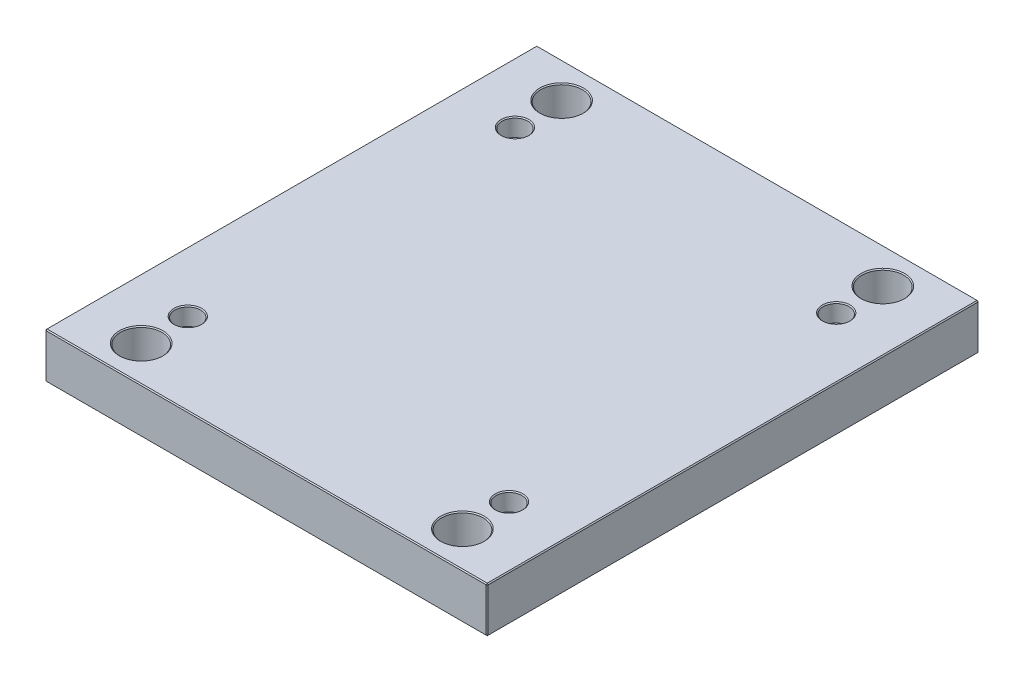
ISO-10303-21;
HEADER;
FILE_DESCRIPTION(('STEP AP214'),'2;1');
FILE_NAME('part.step','',(''),(''),'','','');
FILE_SCHEMA(('AUTOMOTIVE_DESIGN { 1 0 10303 214 1 1 1 1 }'));
ENDSEC;
DATA;
#1=APPLICATION_CONTEXT('core data for automotive mechanical design processes');
#2=APPLICATION_PROTOCOL_DEFINITION('international standard','automotive_design',2000,#1);
#3=PRODUCT_CONTEXT('',#1,'mechanical');
#4=PRODUCT('Part','Part','',(#3));
#5=PRODUCT_RELATED_PRODUCT_CATEGORY('part','',(#4));
#6=PRODUCT_DEFINITION_FORMATION('','',#4);
#7=PRODUCT_DEFINITION_CONTEXT('part definition',#1,'design');
#8=PRODUCT_DEFINITION('design','',#6,#7);
#9=PRODUCT_DEFINITION_SHAPE('','',#8);
#10=(LENGTH_UNIT() NAMED_UNIT(*) SI_UNIT(.MILLI.,.METRE.));
#11=(NAMED_UNIT(*) PLANE_ANGLE_UNIT() SI_UNIT($,.RADIAN.));
#12=(NAMED_UNIT(*) SI_UNIT($,.STERADIAN.) SOLID_ANGLE_UNIT());
#13=UNCERTAINTY_MEASURE_WITH_UNIT(LENGTH_MEASURE(1.E-05),#10,'distance_accuracy_value','');
#14=(GEOMETRIC_REPRESENTATION_CONTEXT(3) GLOBAL_UNCERTAINTY_ASSIGNED_CONTEXT((#13)) GLOBAL_UNIT_ASSIGNED_CONTEXT((#10,
#11,#12)) REPRESENTATION_CONTEXT('',''));
#15=CARTESIAN_POINT('',(0.,0.,0.));
#16=DIRECTION('',(0.,0.,1.));
#17=DIRECTION('',(1.,0.,0.));
#18=AXIS2_PLACEMENT_3D('',#15,#16,#17);
#19=CARTESIAN_POINT('',(-223.,46.,248.));
#20=DIRECTION('',(1.,0.,0.));
#21=DIRECTION('',(0.,0.,-1.));
#22=AXIS2_PLACEMENT_3D('',#19,#20,#21);
#23=PLANE('',#22);
#24=DIRECTION('',(0.,-1.,0.));
#25=VECTOR('',#24,1.);
#26=CARTESIAN_POINT('',(-223.,46.,-247.));
#27=LINE('',#26,#25);
#28=CARTESIAN_POINT('',(-223.,45.,-247.));
#29=VERTEX_POINT('',#28);
#30=CARTESIAN_POINT('',(-223.,1.00000000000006,-247.));
#31=VERTEX_POINT('',#30);
#32=EDGE_CURVE('E115',#29,#31,#27,.T.);
#33=ORIENTED_EDGE('',*,*,#32,.T.);
#34=DIRECTION('',(0.,0.,1.));
#35=VECTOR('',#34,1.);
#36=CARTESIAN_POINT('',(-223.,1.00000000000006,248.));
#37=LINE('',#36,#35);
#38=CARTESIAN_POINT('',(-223.,1.00000000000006,247.));
#39=VERTEX_POINT('',#38);
#40=EDGE_CURVE('E111',#31,#39,#37,.T.);
#41=ORIENTED_EDGE('',*,*,#40,.T.);
#42=DIRECTION('',(0.,1.,0.));
#43=VECTOR('',#42,1.);
#44=CARTESIAN_POINT('',(-223.,46.,247.));
#45=LINE('',#44,#43);
#46=CARTESIAN_POINT('',(-223.,45.,247.));
#47=VERTEX_POINT('',#46);
#48=EDGE_CURVE('E104',#39,#47,#45,.T.);
#49=ORIENTED_EDGE('',*,*,#48,.T.);
#50=DIRECTION('',(0.,0.,-1.));
#51=VECTOR('',#50,1.);
#52=CARTESIAN_POINT('',(-223.,45.,-248.));
#53=LINE('',#52,#51);
#54=EDGE_CURVE('E108',#47,#29,#53,.T.);
#55=ORIENTED_EDGE('',*,*,#54,.T.);
#56=EDGE_LOOP('',(#33,#41,#49,#55));
#57=FACE_BOUND('',#56,.T.);
#58=ADVANCED_FACE('F16',(#57),#23,.F.);
#59=CARTESIAN_POINT('',(223.,46.,248.));
#60=DIRECTION('',(0.,0.,-1.));
#61=DIRECTION('',(-1.,0.,0.));
#62=AXIS2_PLACEMENT_3D('',#59,#60,#61);
#63=PLANE('',#62);
#64=DIRECTION('',(-1.,0.,0.));
#65=VECTOR('',#64,1.);
#66=CARTESIAN_POINT('',(-223.,45.,248.));
#67=LINE('',#66,#65);
#68=CARTESIAN_POINT('',(222.,45.,248.));
#69=VERTEX_POINT('',#68);
#70=CARTESIAN_POINT('',(-222.,45.,248.));
#71=VERTEX_POINT('',#70);
#72=EDGE_CURVE('E170',#69,#71,#67,.T.);
#73=ORIENTED_EDGE('',*,*,#72,.T.);
#74=DIRECTION('',(0.,-1.,0.));
#75=VECTOR('',#74,1.);
#76=CARTESIAN_POINT('',(-222.,46.,248.));
#77=LINE('',#76,#75);
#78=CARTESIAN_POINT('',(-222.,1.00000000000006,248.));
#79=VERTEX_POINT('',#78);
#80=EDGE_CURVE('E123',#71,#79,#77,.T.);
#81=ORIENTED_EDGE('',*,*,#80,.T.);
#82=DIRECTION('',(1.,0.,0.));
#83=VECTOR('',#82,1.);
#84=CARTESIAN_POINT('',(223.,1.00000000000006,248.));
#85=LINE('',#84,#83);
#86=CARTESIAN_POINT('',(222.,1.00000000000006,248.));
#87=VERTEX_POINT('',#86);
#88=EDGE_CURVE('E174',#79,#87,#85,.T.);
#89=ORIENTED_EDGE('',*,*,#88,.T.);
#90=DIRECTION('',(0.,1.,0.));
#91=VECTOR('',#90,1.);
#92=CARTESIAN_POINT('',(222.,46.,248.));
#93=LINE('',#92,#91);
#94=EDGE_CURVE('E172',#87,#69,#93,.T.);
#95=ORIENTED_EDGE('',*,*,#94,.T.);
#96=EDGE_LOOP('',(#73,#81,#89,#95));
#97=FACE_BOUND('',#96,.T.);
#98=ADVANCED_FACE('F413',(#97),#63,.F.);
#99=CARTESIAN_POINT('',(223.,46.,248.));
#100=DIRECTION('',(-1.,0.,0.));
#101=DIRECTION('',(0.,0.,1.));
#102=AXIS2_PLACEMENT_3D('',#99,#100,#101);
#103=PLANE('',#102);
#104=DIRECTION('',(0.,0.,-1.));
#105=VECTOR('',#104,1.);
#106=CARTESIAN_POINT('',(223.,1.00000000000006,248.));
#107=LINE('',#106,#105);
#108=CARTESIAN_POINT('',(223.,1.00000000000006,247.));
#109=VERTEX_POINT('',#108);
#110=CARTESIAN_POINT('',(223.,1.00000000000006,-247.));
#111=VERTEX_POINT('',#110);
#112=EDGE_CURVE('E165',#109,#111,#107,.T.);
#113=ORIENTED_EDGE('',*,*,#112,.T.);
#114=DIRECTION('',(0.,1.,0.));
#115=VECTOR('',#114,1.);
#116=CARTESIAN_POINT('',(223.,46.,-247.));
#117=LINE('',#116,#115);
#118=CARTESIAN_POINT('',(223.,45.,-247.));
#119=VERTEX_POINT('',#118);
#120=EDGE_CURVE('E167',#111,#119,#117,.T.);
#121=ORIENTED_EDGE('',*,*,#120,.T.);
#122=DIRECTION('',(0.,0.,1.));
#123=VECTOR('',#122,1.);
#124=CARTESIAN_POINT('',(223.,45.,248.));
#125=LINE('',#124,#123);
#126=CARTESIAN_POINT('',(223.,45.,247.));
#127=VERTEX_POINT('',#126);
#128=EDGE_CURVE('E161',#119,#127,#125,.T.);
#129=ORIENTED_EDGE('',*,*,#128,.T.);
#130=DIRECTION('',(0.,-1.,0.));
#131=VECTOR('',#130,1.);
#132=CARTESIAN_POINT('',(223.,46.,247.));
#133=LINE('',#132,#131);
#134=EDGE_CURVE('E163',#127,#109,#133,.T.);
#135=ORIENTED_EDGE('',*,*,#134,.T.);
#136=EDGE_LOOP('',(#113,#121,#129,#135));
#137=FACE_BOUND('',#136,.T.);
#138=ADVANCED_FACE('F406',(#137),#103,.F.);
#139=CARTESIAN_POINT('',(223.,46.,-248.));
#140=DIRECTION('',(0.,0.,1.));
#141=DIRECTION('',(1.,0.,0.));
#142=AXIS2_PLACEMENT_3D('',#139,#140,#141);
#143=PLANE('',#142);
#144=DIRECTION('',(0.,-1.,0.));
#145=VECTOR('',#144,1.);
#146=CARTESIAN_POINT('',(222.,46.,-248.));
#147=LINE('',#146,#145);
#148=CARTESIAN_POINT('',(222.,45.,-248.));
#149=VERTEX_POINT('',#148);
#150=CARTESIAN_POINT('',(222.,1.00000000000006,-248.));
#151=VERTEX_POINT('',#150);
#152=EDGE_CURVE('E154',#149,#151,#147,.T.);
#153=ORIENTED_EDGE('',*,*,#152,.T.);
#154=DIRECTION('',(-1.,0.,0.));
#155=VECTOR('',#154,1.);
#156=CARTESIAN_POINT('',(223.,1.00000000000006,-248.));
#157=LINE('',#156,#155);
#158=CARTESIAN_POINT('',(-222.,1.00000000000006,-248.));
#159=VERTEX_POINT('',#158);
#160=EDGE_CURVE('E159',#151,#159,#157,.T.);
#161=ORIENTED_EDGE('',*,*,#160,.T.);
#162=DIRECTION('',(0.,1.,0.));
#163=VECTOR('',#162,1.);
#164=CARTESIAN_POINT('',(-222.,46.,-248.));
#165=LINE('',#164,#163);
#166=CARTESIAN_POINT('',(-222.,45.,-248.));
#167=VERTEX_POINT('',#166);
#168=EDGE_CURVE('E156',#159,#167,#165,.T.);
#169=ORIENTED_EDGE('',*,*,#168,.T.);
#170=DIRECTION('',(1.,0.,0.));
#171=VECTOR('',#170,1.);
#172=CARTESIAN_POINT('',(223.,45.,-248.));
#173=LINE('',#172,#171);
#174=EDGE_CURVE('E152',#167,#149,#173,.T.);
#175=ORIENTED_EDGE('',*,*,#174,.T.);
#176=EDGE_LOOP('',(#153,#161,#169,#175));
#177=FACE_BOUND('',#176,.T.);
#178=ADVANCED_FACE('F431',(#177),#143,.F.);
#179=CARTESIAN_POINT('',(0.,46.,0.));
#180=DIRECTION('',(0.,1.,0.));
#181=DIRECTION('',(0.,0.,1.));
#182=AXIS2_PLACEMENT_3D('',#179,#180,#181);
#183=PLANE('',#182);
#184=CARTESIAN_POINT('',(-162.,46.,212.));
#185=DIRECTION('',(0.,1.,0.));
#186=DIRECTION('',(0.,0.,1.));
#187=AXIS2_PLACEMENT_3D('',#184,#185,#186);
#188=CIRCLE('',#187,22.);
#189=CARTESIAN_POINT('',(-162.,46.,234.));
#190=VERTEX_POINT('',#189);
#191=EDGE_CURVE('E317',#190,#190,#188,.F.);
#192=ORIENTED_EDGE('',*,*,#191,.T.);
#193=EDGE_LOOP('',(#192));
#194=FACE_BOUND('',#193,.T.);
#195=CARTESIAN_POINT('',(162.,46.,212.));
#196=DIRECTION('',(0.,1.,0.));
#197=DIRECTION('',(0.,0.,1.));
#198=AXIS2_PLACEMENT_3D('',#195,#196,#197);
#199=CIRCLE('',#198,22.);
#200=CARTESIAN_POINT('',(162.,46.,234.));
#201=VERTEX_POINT('',#200);
#202=EDGE_CURVE('E314',#201,#201,#199,.F.);
#203=ORIENTED_EDGE('',*,*,#202,.T.);
#204=EDGE_LOOP('',(#203));
#205=FACE_BOUND('',#204,.T.);
#206=CARTESIAN_POINT('',(162.,46.,-212.));
#207=DIRECTION('',(0.,1.,0.));
#208=DIRECTION('',(0.,0.,1.));
#209=AXIS2_PLACEMENT_3D('',#206,#207,#208);
#210=CIRCLE('',#209,22.);
#211=CARTESIAN_POINT('',(162.,46.,-190.));
#212=VERTEX_POINT('',#211);
#213=EDGE_CURVE('E311',#212,#212,#210,.F.);
#214=ORIENTED_EDGE('',*,*,#213,.T.);
#215=EDGE_LOOP('',(#214));
#216=FACE_BOUND('',#215,.T.);
#217=CARTESIAN_POINT('',(-162.,46.,-212.));
#218=DIRECTION('',(0.,1.,0.));
#219=DIRECTION('',(0.,0.,1.));
#220=AXIS2_PLACEMENT_3D('',#217,#218,#219);
#221=CIRCLE('',#220,22.);
#222=CARTESIAN_POINT('',(-162.,46.,-190.));
#223=VERTEX_POINT('',#222);
#224=EDGE_CURVE('E308',#223,#223,#221,.F.);
#225=ORIENTED_EDGE('',*,*,#224,.T.);
#226=EDGE_LOOP('',(#225));
#227=FACE_BOUND('',#226,.T.);
#228=CARTESIAN_POINT('',(-162.,46.,165.));
#229=DIRECTION('',(0.,1.,0.));
#230=DIRECTION('',(0.,0.,1.));
#231=AXIS2_PLACEMENT_3D('',#228,#229,#230);
#232=CIRCLE('',#231,14.0000000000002);
#233=CARTESIAN_POINT('',(-162.,46.,179.));
#234=VERTEX_POINT('',#233);
#235=EDGE_CURVE('E290',#234,#234,#232,.F.);
#236=ORIENTED_EDGE('',*,*,#235,.T.);
#237=EDGE_LOOP('',(#236));
#238=FACE_BOUND('',#237,.T.);
#239=CARTESIAN_POINT('',(162.,46.,165.));
#240=DIRECTION('',(0.,1.,0.));
#241=DIRECTION('',(0.,0.,1.));
#242=AXIS2_PLACEMENT_3D('',#239,#240,#241);
#243=CIRCLE('',#242,13.9999999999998);
#244=CARTESIAN_POINT('',(162.,46.,179.));
#245=VERTEX_POINT('',#244);
#246=EDGE_CURVE('E287',#245,#245,#243,.F.);
#247=ORIENTED_EDGE('',*,*,#246,.T.);
#248=EDGE_LOOP('',(#247));
#249=FACE_BOUND('',#248,.T.);
#250=CARTESIAN_POINT('',(162.,46.,-165.));
#251=DIRECTION('',(0.,1.,0.));
#252=DIRECTION('',(0.,0.,1.));
#253=AXIS2_PLACEMENT_3D('',#250,#251,#252);
#254=CIRCLE('',#253,14.0000000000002);
#255=CARTESIAN_POINT('',(162.,46.,-151.));
#256=VERTEX_POINT('',#255);
#257=EDGE_CURVE('E284',#256,#256,#254,.F.);
#258=ORIENTED_EDGE('',*,*,#257,.T.);
#259=EDGE_LOOP('',(#258));
#260=FACE_BOUND('',#259,.T.);
#261=CARTESIAN_POINT('',(-162.,46.,-165.));
#262=DIRECTION('',(0.,1.,0.));
#263=DIRECTION('',(0.,0.,1.));
#264=AXIS2_PLACEMENT_3D('',#261,#262,#263);
#265=CIRCLE('',#264,13.9999999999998);
#266=CARTESIAN_POINT('',(-162.,46.,-151.));
#267=VERTEX_POINT('',#266);
#268=EDGE_CURVE('E281',#267,#267,#265,.F.);
#269=ORIENTED_EDGE('',*,*,#268,.T.);
#270=EDGE_LOOP('',(#269));
#271=FACE_BOUND('',#270,.T.);
#272=DIRECTION('',(0.,0.,-1.));
#273=VECTOR('',#272,1.);
#274=CARTESIAN_POINT('',(222.,46.,-248.));
#275=LINE('',#274,#273);
#276=CARTESIAN_POINT('',(222.,46.,247.));
#277=VERTEX_POINT('',#276);
#278=CARTESIAN_POINT('',(222.,46.,-247.));
#279=VERTEX_POINT('',#278);
#280=EDGE_CURVE('E31',#277,#279,#275,.T.);
#281=ORIENTED_EDGE('',*,*,#280,.T.);
#282=DIRECTION('',(-1.,0.,0.));
#283=VECTOR('',#282,1.);
#284=CARTESIAN_POINT('',(-223.,46.,-247.));
#285=LINE('',#284,#283);
#286=CARTESIAN_POINT('',(-222.,46.,-247.));
#287=VERTEX_POINT('',#286);
#288=EDGE_CURVE('E190',#279,#287,#285,.T.);
#289=ORIENTED_EDGE('',*,*,#288,.T.);
#290=DIRECTION('',(0.,0.,1.));
#291=VECTOR('',#290,1.);
#292=CARTESIAN_POINT('',(-222.,46.,248.));
#293=LINE('',#292,#291);
#294=CARTESIAN_POINT('',(-222.,46.,247.));
#295=VERTEX_POINT('',#294);
#296=EDGE_CURVE('E186',#287,#295,#293,.T.);
#297=ORIENTED_EDGE('',*,*,#296,.T.);
#298=DIRECTION('',(1.,0.,0.));
#299=VECTOR('',#298,1.);
#300=CARTESIAN_POINT('',(223.,46.,247.));
#301=LINE('',#300,#299);
#302=EDGE_CURVE('E36',#295,#277,#301,.T.);
#303=ORIENTED_EDGE('',*,*,#302,.T.);
#304=EDGE_LOOP('',(#281,#289,#297,#303));
#305=FACE_BOUND('',#304,.T.);
#306=ADVANCED_FACE('F357',(#194,#205,#216,#227,#238,#249,#260,#271,#305),#183,.T.);
#307=CARTESIAN_POINT('',(0.,0.,0.));
#308=DIRECTION('',(0.,1.,0.));
#309=DIRECTION('',(0.,0.,1.));
#310=AXIS2_PLACEMENT_3D('',#307,#308,#309);
#311=PLANE('',#310);
#312=CARTESIAN_POINT('',(-162.,0.,212.));
#313=DIRECTION('',(0.,1.,0.));
#314=DIRECTION('',(0.,0.,1.));
#315=AXIS2_PLACEMENT_3D('',#312,#313,#314);
#316=CIRCLE('',#315,22.);
#317=CARTESIAN_POINT('',(-162.,0.,234.));
#318=VERTEX_POINT('',#317);
#319=EDGE_CURVE('E329',#318,#318,#316,.T.);
#320=ORIENTED_EDGE('',*,*,#319,.T.);
#321=EDGE_LOOP('',(#320));
#322=FACE_BOUND('',#321,.T.);
#323=CARTESIAN_POINT('',(162.,0.,212.));
#324=DIRECTION('',(0.,1.,0.));
#325=DIRECTION('',(0.,0.,1.));
#326=AXIS2_PLACEMENT_3D('',#323,#324,#325);
#327=CIRCLE('',#326,22.);
#328=CARTESIAN_POINT('',(162.,0.,234.));
#329=VERTEX_POINT('',#328);
#330=EDGE_CURVE('E326',#329,#329,#327,.T.);
#331=ORIENTED_EDGE('',*,*,#330,.T.);
#332=EDGE_LOOP('',(#331));
#333=FACE_BOUND('',#332,.T.);
#334=CARTESIAN_POINT('',(162.,0.,-212.));
#335=DIRECTION('',(0.,1.,0.));
#336=DIRECTION('',(0.,0.,1.));
#337=AXIS2_PLACEMENT_3D('',#334,#335,#336);
#338=CIRCLE('',#337,22.);
#339=CARTESIAN_POINT('',(162.,0.,-190.));
#340=VERTEX_POINT('',#339);
#341=EDGE_CURVE('E323',#340,#340,#338,.T.);
#342=ORIENTED_EDGE('',*,*,#341,.T.);
#343=EDGE_LOOP('',(#342));
#344=FACE_BOUND('',#343,.T.);
#345=CARTESIAN_POINT('',(-162.,0.,-212.));
#346=DIRECTION('',(0.,1.,0.));
#347=DIRECTION('',(0.,0.,1.));
#348=AXIS2_PLACEMENT_3D('',#345,#346,#347);
#349=CIRCLE('',#348,22.);
#350=CARTESIAN_POINT('',(-162.,0.,-190.));
#351=VERTEX_POINT('',#350);
#352=EDGE_CURVE('E320',#351,#351,#349,.T.);
#353=ORIENTED_EDGE('',*,*,#352,.T.);
#354=EDGE_LOOP('',(#353));
#355=FACE_BOUND('',#354,.T.);
#356=CARTESIAN_POINT('',(162.,0.,-165.));
#357=DIRECTION('',(0.,1.,0.));
#358=DIRECTION('',(0.,0.,1.));
#359=AXIS2_PLACEMENT_3D('',#356,#357,#358);
#360=CIRCLE('',#359,10.0000000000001);
#361=CARTESIAN_POINT('',(162.,0.,-155.));
#362=VERTEX_POINT('',#361);
#363=EDGE_CURVE('E263',#362,#362,#360,.T.);
#364=ORIENTED_EDGE('',*,*,#363,.T.);
#365=EDGE_LOOP('',(#364));
#366=FACE_BOUND('',#365,.T.);
#367=CARTESIAN_POINT('',(162.,0.,165.));
#368=DIRECTION('',(0.,1.,0.));
#369=DIRECTION('',(0.,0.,1.));
#370=AXIS2_PLACEMENT_3D('',#367,#368,#369);
#371=CIRCLE('',#370,10.);
#372=CARTESIAN_POINT('',(162.,0.,175.));
#373=VERTEX_POINT('',#372);
#374=EDGE_CURVE('E260',#373,#373,#371,.T.);
#375=ORIENTED_EDGE('',*,*,#374,.T.);
#376=EDGE_LOOP('',(#375));
#377=FACE_BOUND('',#376,.T.);
#378=CARTESIAN_POINT('',(-162.,0.,165.));
#379=DIRECTION('',(0.,1.,0.));
#380=DIRECTION('',(0.,0.,1.));
#381=AXIS2_PLACEMENT_3D('',#378,#379,#380);
#382=CIRCLE('',#381,10.0000000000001);
#383=CARTESIAN_POINT('',(-162.,0.,175.));
#384=VERTEX_POINT('',#383);
#385=EDGE_CURVE('E257',#384,#384,#382,.T.);
#386=ORIENTED_EDGE('',*,*,#385,.T.);
#387=EDGE_LOOP('',(#386));
#388=FACE_BOUND('',#387,.T.);
#389=CARTESIAN_POINT('',(-162.,0.,-165.));
#390=DIRECTION('',(0.,1.,0.));
#391=DIRECTION('',(0.,0.,1.));
#392=AXIS2_PLACEMENT_3D('',#389,#390,#391);
#393=CIRCLE('',#392,10.);
#394=CARTESIAN_POINT('',(-162.,0.,-155.));
#395=VERTEX_POINT('',#394);
#396=EDGE_CURVE('E192',#395,#395,#393,.T.);
#397=ORIENTED_EDGE('',*,*,#396,.T.);
#398=EDGE_LOOP('',(#397));
#399=FACE_BOUND('',#398,.T.);
#400=DIRECTION('',(0.,0.,1.));
#401=VECTOR('',#400,1.);
#402=CARTESIAN_POINT('',(222.,0.,0.));
#403=LINE('',#402,#401);
#404=CARTESIAN_POINT('',(222.,0.,-247.));
#405=VERTEX_POINT('',#404);
#406=CARTESIAN_POINT('',(222.,0.,247.));
#407=VERTEX_POINT('',#406);
#408=EDGE_CURVE('E177',#405,#407,#403,.T.);
#409=ORIENTED_EDGE('',*,*,#408,.T.);
#410=DIRECTION('',(-1.,0.,0.));
#411=VECTOR('',#410,1.);
#412=CARTESIAN_POINT('',(0.,0.,247.));
#413=LINE('',#412,#411);
#414=CARTESIAN_POINT('',(-222.,0.,247.));
#415=VERTEX_POINT('',#414);
#416=EDGE_CURVE('E183',#407,#415,#413,.T.);
#417=ORIENTED_EDGE('',*,*,#416,.T.);
#418=DIRECTION('',(0.,0.,-1.));
#419=VECTOR('',#418,1.);
#420=CARTESIAN_POINT('',(-222.,0.,0.));
#421=LINE('',#420,#419);
#422=CARTESIAN_POINT('',(-222.,0.,-247.));
#423=VERTEX_POINT('',#422);
#424=EDGE_CURVE('E181',#415,#423,#421,.T.);
#425=ORIENTED_EDGE('',*,*,#424,.T.);
#426=DIRECTION('',(1.,0.,0.));
#427=VECTOR('',#426,1.);
#428=CARTESIAN_POINT('',(0.,0.,-247.));
#429=LINE('',#428,#427);
#430=EDGE_CURVE('E179',#423,#405,#429,.T.);
#431=ORIENTED_EDGE('',*,*,#430,.T.);
#432=EDGE_LOOP('',(#409,#417,#425,#431));
#433=FACE_BOUND('',#432,.T.);
#434=ADVANCED_FACE('F353',(#322,#333,#344,#355,#366,#377,#388,#399,#433),#311,.F.);
#435=CARTESIAN_POINT('',(223.,46.,247.));
#436=DIRECTION('',(-0.707106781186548,0.,-0.707106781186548));
#437=DIRECTION('',(0.,-1.,0.));
#438=AXIS2_PLACEMENT_3D('',#435,#436,#437);
#439=PLANE('',#438);
#440=DIRECTION('',(-0.707106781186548,0.,0.707106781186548));
#441=VECTOR('',#440,1.);
#442=CARTESIAN_POINT('',(222.,45.,248.));
#443=LINE('',#442,#441);
#444=EDGE_CURVE('E141',#69,#127,#443,.F.);
#445=ORIENTED_EDGE('',*,*,#444,.F.);
#446=ORIENTED_EDGE('',*,*,#94,.F.);
#447=DIRECTION('',(0.707106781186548,0.,-0.707106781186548));
#448=VECTOR('',#447,1.);
#449=CARTESIAN_POINT('',(222.,1.00000000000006,248.));
#450=LINE('',#449,#448);
#451=EDGE_CURVE('E144',#109,#87,#450,.F.);
#452=ORIENTED_EDGE('',*,*,#451,.F.);
#453=ORIENTED_EDGE('',*,*,#134,.F.);
#454=EDGE_LOOP('',(#445,#446,#452,#453));
#455=FACE_BOUND('',#454,.T.);
#456=ADVANCED_FACE('F356',(#455),#439,.F.);
#457=CARTESIAN_POINT('',(222.,45.,248.));
#458=DIRECTION('',(0.577350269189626,0.577350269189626,0.577350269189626));
#459=DIRECTION('',(0.707106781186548,0.,-0.707106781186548));
#460=AXIS2_PLACEMENT_3D('',#457,#458,#459);
#461=PLANE('',#460);
#462=DIRECTION('',(0.,-0.707106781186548,0.707106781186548));
#463=VECTOR('',#462,1.);
#464=CARTESIAN_POINT('',(222.,45.,248.));
#465=LINE('',#464,#463);
#466=EDGE_CURVE('E235',#69,#277,#465,.F.);
#467=ORIENTED_EDGE('',*,*,#466,.F.);
#468=ORIENTED_EDGE('',*,*,#444,.T.);
#469=DIRECTION('',(-0.707106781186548,0.707106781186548,0.));
#470=VECTOR('',#469,1.);
#471=CARTESIAN_POINT('',(222.5,45.5,247.));
#472=LINE('',#471,#470);
#473=EDGE_CURVE('E237',#277,#127,#472,.F.);
#474=ORIENTED_EDGE('',*,*,#473,.F.);
#475=EDGE_LOOP('',(#467,#468,#474));
#476=FACE_BOUND('',#475,.T.);
#477=ADVANCED_FACE('F419',(#476),#461,.T.);
#478=CARTESIAN_POINT('',(222.,1.00000000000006,248.));
#479=DIRECTION('',(0.577350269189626,-0.577350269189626,0.577350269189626));
#480=DIRECTION('',(0.707106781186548,0.,-0.707106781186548));
#481=AXIS2_PLACEMENT_3D('',#478,#479,#480);
#482=PLANE('',#481);
#483=DIRECTION('',(-0.707106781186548,-0.707106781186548,0.));
#484=VECTOR('',#483,1.);
#485=CARTESIAN_POINT('',(222.5,0.500000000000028,247.));
#486=LINE('',#485,#484);
#487=EDGE_CURVE('E229',#109,#407,#486,.T.);
#488=ORIENTED_EDGE('',*,*,#487,.F.);
#489=ORIENTED_EDGE('',*,*,#451,.T.);
#490=DIRECTION('',(0.,0.707106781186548,0.707106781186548));
#491=VECTOR('',#490,1.);
#492=CARTESIAN_POINT('',(222.,1.00000000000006,248.));
#493=LINE('',#492,#491);
#494=EDGE_CURVE('E232',#407,#87,#493,.T.);
#495=ORIENTED_EDGE('',*,*,#494,.F.);
#496=EDGE_LOOP('',(#488,#489,#495));
#497=FACE_BOUND('',#496,.T.);
#498=ADVANCED_FACE('F378',(#497),#482,.T.);
#499=CARTESIAN_POINT('',(222.,46.,0.));
#500=DIRECTION('',(0.707106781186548,0.707106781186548,0.));
#501=DIRECTION('',(0.,0.,1.));
#502=AXIS2_PLACEMENT_3D('',#499,#500,#501);
#503=PLANE('',#502);
#504=ORIENTED_EDGE('',*,*,#473,.T.);
#505=ORIENTED_EDGE('',*,*,#128,.F.);
#506=DIRECTION('',(0.707106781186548,-0.707106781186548,0.));
#507=VECTOR('',#506,1.);
#508=CARTESIAN_POINT('',(223.,45.,-247.));
#509=LINE('',#508,#507);
#510=EDGE_CURVE('E224',#279,#119,#509,.T.);
#511=ORIENTED_EDGE('',*,*,#510,.F.);
#512=ORIENTED_EDGE('',*,*,#280,.F.);
#513=EDGE_LOOP('',(#504,#505,#511,#512));
#514=FACE_BOUND('',#513,.T.);
#515=ADVANCED_FACE('F421',(#514),#503,.T.);
#516=CARTESIAN_POINT('',(0.,46.,247.));
#517=DIRECTION('',(0.,0.707106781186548,0.707106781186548));
#518=DIRECTION('',(-1.,0.,0.));
#519=AXIS2_PLACEMENT_3D('',#516,#517,#518);
#520=PLANE('',#519);
#521=ORIENTED_EDGE('',*,*,#466,.T.);
#522=ORIENTED_EDGE('',*,*,#302,.F.);
#523=DIRECTION('',(0.,0.707106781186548,-0.707106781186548));
#524=VECTOR('',#523,1.);
#525=CARTESIAN_POINT('',(-222.,45.5,247.5));
#526=LINE('',#525,#524);
#527=EDGE_CURVE('E127',#71,#295,#526,.T.);
#528=ORIENTED_EDGE('',*,*,#527,.F.);
#529=ORIENTED_EDGE('',*,*,#72,.F.);
#530=EDGE_LOOP('',(#521,#522,#528,#529));
#531=FACE_BOUND('',#530,.T.);
#532=ADVANCED_FACE('F416',(#531),#520,.T.);
#533=CARTESIAN_POINT('',(-222.,46.,248.));
#534=DIRECTION('',(0.707106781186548,0.,-0.707106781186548));
#535=DIRECTION('',(0.,-1.,0.));
#536=AXIS2_PLACEMENT_3D('',#533,#534,#535);
#537=PLANE('',#536);
#538=DIRECTION('',(0.707106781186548,0.,0.707106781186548));
#539=VECTOR('',#538,1.);
#540=CARTESIAN_POINT('',(-222.,1.00000000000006,248.));
#541=LINE('',#540,#539);
#542=EDGE_CURVE('E128',#79,#39,#541,.F.);
#543=ORIENTED_EDGE('',*,*,#542,.F.);
#544=ORIENTED_EDGE('',*,*,#80,.F.);
#545=DIRECTION('',(-0.707106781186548,0.,-0.707106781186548));
#546=VECTOR('',#545,1.);
#547=CARTESIAN_POINT('',(-223.,45.,247.));
#548=LINE('',#547,#546);
#549=EDGE_CURVE('E119',#47,#71,#548,.F.);
#550=ORIENTED_EDGE('',*,*,#549,.F.);
#551=ORIENTED_EDGE('',*,*,#48,.F.);
#552=EDGE_LOOP('',(#543,#544,#550,#551));
#553=FACE_BOUND('',#552,.T.);
#554=ADVANCED_FACE('F121',(#553),#537,.F.);
#555=CARTESIAN_POINT('',(223.,1.00000000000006,248.));
#556=DIRECTION('',(0.,0.707106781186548,-0.707106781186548));
#557=DIRECTION('',(1.,0.,0.));
#558=AXIS2_PLACEMENT_3D('',#555,#556,#557);
#559=PLANE('',#558);
#560=ORIENTED_EDGE('',*,*,#494,.T.);
#561=ORIENTED_EDGE('',*,*,#88,.F.);
#562=DIRECTION('',(0.,-0.707106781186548,-0.707106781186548));
#563=VECTOR('',#562,1.);
#564=CARTESIAN_POINT('',(-222.,1.00000000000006,248.));
#565=LINE('',#564,#563);
#566=EDGE_CURVE('E220',#415,#79,#565,.F.);
#567=ORIENTED_EDGE('',*,*,#566,.F.);
#568=ORIENTED_EDGE('',*,*,#416,.F.);
#569=EDGE_LOOP('',(#560,#561,#567,#568));
#570=FACE_BOUND('',#569,.T.);
#571=ADVANCED_FACE('F383',(#570),#559,.F.);
#572=CARTESIAN_POINT('',(223.,1.00000000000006,248.));
#573=DIRECTION('',(-0.707106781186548,0.707106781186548,0.));
#574=DIRECTION('',(0.,0.,-1.));
#575=AXIS2_PLACEMENT_3D('',#572,#573,#574);
#576=PLANE('',#575);
#577=ORIENTED_EDGE('',*,*,#487,.T.);
#578=ORIENTED_EDGE('',*,*,#408,.F.);
#579=DIRECTION('',(0.707106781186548,0.707106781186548,0.));
#580=VECTOR('',#579,1.);
#581=CARTESIAN_POINT('',(222.5,0.500000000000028,-247.));
#582=LINE('',#581,#580);
#583=EDGE_CURVE('E217',#111,#405,#582,.F.);
#584=ORIENTED_EDGE('',*,*,#583,.F.);
#585=ORIENTED_EDGE('',*,*,#112,.F.);
#586=EDGE_LOOP('',(#577,#578,#584,#585));
#587=FACE_BOUND('',#586,.T.);
#588=ADVANCED_FACE('F376',(#587),#576,.F.);
#589=CARTESIAN_POINT('',(222.,46.,-248.));
#590=DIRECTION('',(-0.707106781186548,0.,0.707106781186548));
#591=DIRECTION('',(0.,-1.,0.));
#592=AXIS2_PLACEMENT_3D('',#589,#590,#591);
#593=PLANE('',#592);
#594=DIRECTION('',(0.707106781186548,0.,0.707106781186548));
#595=VECTOR('',#594,1.);
#596=CARTESIAN_POINT('',(223.,45.,-247.));
#597=LINE('',#596,#595);
#598=EDGE_CURVE('E226',#119,#149,#597,.F.);
#599=ORIENTED_EDGE('',*,*,#598,.F.);
#600=ORIENTED_EDGE('',*,*,#120,.F.);
#601=DIRECTION('',(-0.707106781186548,0.,-0.707106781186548));
#602=VECTOR('',#601,1.);
#603=CARTESIAN_POINT('',(222.,1.00000000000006,-248.));
#604=LINE('',#603,#602);
#605=EDGE_CURVE('E214',#151,#111,#604,.F.);
#606=ORIENTED_EDGE('',*,*,#605,.F.);
#607=ORIENTED_EDGE('',*,*,#152,.F.);
#608=EDGE_LOOP('',(#599,#600,#606,#607));
#609=FACE_BOUND('',#608,.T.);
#610=ADVANCED_FACE('F403',(#609),#593,.F.);
#611=CARTESIAN_POINT('',(223.,45.,-247.));
#612=DIRECTION('',(0.577350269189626,0.577350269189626,-0.577350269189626));
#613=DIRECTION('',(-0.707106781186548,0.,-0.707106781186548));
#614=AXIS2_PLACEMENT_3D('',#611,#612,#613);
#615=PLANE('',#614);
#616=ORIENTED_EDGE('',*,*,#510,.T.);
#617=ORIENTED_EDGE('',*,*,#598,.T.);
#618=DIRECTION('',(0.,0.707106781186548,0.707106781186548));
#619=VECTOR('',#618,1.);
#620=CARTESIAN_POINT('',(222.,45.5,-247.5));
#621=LINE('',#620,#619);
#622=EDGE_CURVE('E135',#279,#149,#621,.F.);
#623=ORIENTED_EDGE('',*,*,#622,.F.);
#624=EDGE_LOOP('',(#616,#617,#623));
#625=FACE_BOUND('',#624,.T.);
#626=ADVANCED_FACE('F425',(#625),#615,.T.);
#627=CARTESIAN_POINT('',(-223.,45.,247.));
#628=DIRECTION('',(-0.577350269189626,0.577350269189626,0.577350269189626));
#629=DIRECTION('',(0.707106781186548,0.,0.707106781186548));
#630=AXIS2_PLACEMENT_3D('',#627,#628,#629);
#631=PLANE('',#630);
#632=ORIENTED_EDGE('',*,*,#549,.T.);
#633=ORIENTED_EDGE('',*,*,#527,.T.);
#634=DIRECTION('',(-0.707106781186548,-0.707106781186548,0.));
#635=VECTOR('',#634,1.);
#636=CARTESIAN_POINT('',(-223.,45.,247.));
#637=LINE('',#636,#635);
#638=EDGE_CURVE('E131',#47,#295,#637,.F.);
#639=ORIENTED_EDGE('',*,*,#638,.F.);
#640=EDGE_LOOP('',(#632,#633,#639));
#641=FACE_BOUND('',#640,.T.);
#642=ADVANCED_FACE('F132',(#641),#631,.T.);
#643=CARTESIAN_POINT('',(-222.,1.00000000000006,248.));
#644=DIRECTION('',(-0.577350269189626,-0.577350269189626,0.577350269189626));
#645=DIRECTION('',(0.707106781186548,0.,0.707106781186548));
#646=AXIS2_PLACEMENT_3D('',#643,#644,#645);
#647=PLANE('',#646);
#648=ORIENTED_EDGE('',*,*,#566,.T.);
#649=ORIENTED_EDGE('',*,*,#542,.T.);
#650=DIRECTION('',(-0.707106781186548,0.707106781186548,0.));
#651=VECTOR('',#650,1.);
#652=CARTESIAN_POINT('',(-222.5,0.500000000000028,247.));
#653=LINE('',#652,#651);
#654=EDGE_CURVE('E136',#415,#39,#653,.T.);
#655=ORIENTED_EDGE('',*,*,#654,.F.);
#656=EDGE_LOOP('',(#648,#649,#655));
#657=FACE_BOUND('',#656,.T.);
#658=ADVANCED_FACE('F386',(#657),#647,.T.);
#659=CARTESIAN_POINT('',(222.,1.00000000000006,-248.));
#660=DIRECTION('',(0.577350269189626,-0.577350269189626,-0.577350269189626));
#661=DIRECTION('',(-0.707106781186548,0.,-0.707106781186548));
#662=AXIS2_PLACEMENT_3D('',#659,#660,#661);
#663=PLANE('',#662);
#664=ORIENTED_EDGE('',*,*,#605,.T.);
#665=ORIENTED_EDGE('',*,*,#583,.T.);
#666=DIRECTION('',(0.,-0.707106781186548,0.707106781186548));
#667=VECTOR('',#666,1.);
#668=CARTESIAN_POINT('',(222.,1.00000000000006,-248.));
#669=LINE('',#668,#667);
#670=EDGE_CURVE('E207',#151,#405,#669,.T.);
#671=ORIENTED_EDGE('',*,*,#670,.F.);
#672=EDGE_LOOP('',(#664,#665,#671));
#673=FACE_BOUND('',#672,.T.);
#674=ADVANCED_FACE('F397',(#673),#663,.T.);
#675=CARTESIAN_POINT('',(0.,46.,-247.));
#676=DIRECTION('',(0.,0.707106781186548,-0.707106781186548));
#677=DIRECTION('',(1.,0.,0.));
#678=AXIS2_PLACEMENT_3D('',#675,#676,#677);
#679=PLANE('',#678);
#680=ORIENTED_EDGE('',*,*,#622,.T.);
#681=ORIENTED_EDGE('',*,*,#174,.F.);
#682=DIRECTION('',(0.,-0.707106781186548,-0.707106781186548));
#683=VECTOR('',#682,1.);
#684=CARTESIAN_POINT('',(-222.,45.,-248.));
#685=LINE('',#684,#683);
#686=EDGE_CURVE('E204',#287,#167,#685,.T.);
#687=ORIENTED_EDGE('',*,*,#686,.F.);
#688=ORIENTED_EDGE('',*,*,#288,.F.);
#689=EDGE_LOOP('',(#680,#681,#687,#688));
#690=FACE_BOUND('',#689,.T.);
#691=ADVANCED_FACE('F429',(#690),#679,.T.);
#692=CARTESIAN_POINT('',(-222.,46.,0.));
#693=DIRECTION('',(-0.707106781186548,0.707106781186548,0.));
#694=DIRECTION('',(0.,0.,-1.));
#695=AXIS2_PLACEMENT_3D('',#692,#693,#694);
#696=PLANE('',#695);
#697=ORIENTED_EDGE('',*,*,#638,.T.);
#698=ORIENTED_EDGE('',*,*,#296,.F.);
#699=DIRECTION('',(0.707106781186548,0.707106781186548,0.));
#700=VECTOR('',#699,1.);
#701=CARTESIAN_POINT('',(-222.5,45.5,-247.));
#702=LINE('',#701,#700);
#703=EDGE_CURVE('E139',#29,#287,#702,.T.);
#704=ORIENTED_EDGE('',*,*,#703,.F.);
#705=ORIENTED_EDGE('',*,*,#54,.F.);
#706=EDGE_LOOP('',(#697,#698,#704,#705));
#707=FACE_BOUND('',#706,.T.);
#708=ADVANCED_FACE('F138',(#707),#696,.T.);
#709=CARTESIAN_POINT('',(-223.,1.00000000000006,248.));
#710=DIRECTION('',(0.707106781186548,0.707106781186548,0.));
#711=DIRECTION('',(0.,0.,1.));
#712=AXIS2_PLACEMENT_3D('',#709,#710,#711);
#713=PLANE('',#712);
#714=ORIENTED_EDGE('',*,*,#654,.T.);
#715=ORIENTED_EDGE('',*,*,#40,.F.);
#716=DIRECTION('',(0.707106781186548,-0.707106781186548,0.));
#717=VECTOR('',#716,1.);
#718=CARTESIAN_POINT('',(-223.,1.00000000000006,-247.));
#719=LINE('',#718,#717);
#720=EDGE_CURVE('E200',#423,#31,#719,.F.);
#721=ORIENTED_EDGE('',*,*,#720,.F.);
#722=ORIENTED_EDGE('',*,*,#424,.F.);
#723=EDGE_LOOP('',(#714,#715,#721,#722));
#724=FACE_BOUND('',#723,.T.);
#725=ADVANCED_FACE('F388',(#724),#713,.F.);
#726=CARTESIAN_POINT('',(223.,1.00000000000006,-248.));
#727=DIRECTION('',(0.,0.707106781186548,0.707106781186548));
#728=DIRECTION('',(-1.,0.,0.));
#729=AXIS2_PLACEMENT_3D('',#726,#727,#728);
#730=PLANE('',#729);
#731=ORIENTED_EDGE('',*,*,#670,.T.);
#732=ORIENTED_EDGE('',*,*,#430,.F.);
#733=DIRECTION('',(0.,0.707106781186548,-0.707106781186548));
#734=VECTOR('',#733,1.);
#735=CARTESIAN_POINT('',(-222.,0.500000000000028,-247.5));
#736=LINE('',#735,#734);
#737=EDGE_CURVE('E197',#159,#423,#736,.F.);
#738=ORIENTED_EDGE('',*,*,#737,.F.);
#739=ORIENTED_EDGE('',*,*,#160,.F.);
#740=EDGE_LOOP('',(#731,#732,#738,#739));
#741=FACE_BOUND('',#740,.T.);
#742=ADVANCED_FACE('F392',(#741),#730,.F.);
#743=CARTESIAN_POINT('',(-222.,45.,-248.));
#744=DIRECTION('',(-0.577350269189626,0.577350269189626,-0.577350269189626));
#745=DIRECTION('',(-0.707106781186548,0.,0.707106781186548));
#746=AXIS2_PLACEMENT_3D('',#743,#744,#745);
#747=PLANE('',#746);
#748=ORIENTED_EDGE('',*,*,#703,.T.);
#749=ORIENTED_EDGE('',*,*,#686,.T.);
#750=DIRECTION('',(0.707106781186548,0.,-0.707106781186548));
#751=VECTOR('',#750,1.);
#752=CARTESIAN_POINT('',(-222.,45.,-248.));
#753=LINE('',#752,#751);
#754=EDGE_CURVE('E195',#29,#167,#753,.T.);
#755=ORIENTED_EDGE('',*,*,#754,.F.);
#756=EDGE_LOOP('',(#748,#749,#755));
#757=FACE_BOUND('',#756,.T.);
#758=ADVANCED_FACE('F460',(#757),#747,.T.);
#759=CARTESIAN_POINT('',(-223.,1.00000000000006,-247.));
#760=DIRECTION('',(-0.577350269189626,-0.577350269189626,-0.577350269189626));
#761=DIRECTION('',(-0.707106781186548,0.,0.707106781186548));
#762=AXIS2_PLACEMENT_3D('',#759,#760,#761);
#763=PLANE('',#762);
#764=ORIENTED_EDGE('',*,*,#737,.T.);
#765=ORIENTED_EDGE('',*,*,#720,.T.);
#766=DIRECTION('',(-0.707106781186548,0.,0.707106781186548));
#767=VECTOR('',#766,1.);
#768=CARTESIAN_POINT('',(-223.,1.00000000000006,-247.));
#769=LINE('',#768,#767);
#770=EDGE_CURVE('E193',#159,#31,#769,.T.);
#771=ORIENTED_EDGE('',*,*,#770,.F.);
#772=EDGE_LOOP('',(#764,#765,#771));
#773=FACE_BOUND('',#772,.T.);
#774=ADVANCED_FACE('F456',(#773),#763,.T.);
#775=CARTESIAN_POINT('',(-223.,46.,-247.));
#776=DIRECTION('',(0.707106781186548,0.,0.707106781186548));
#777=DIRECTION('',(0.,-1.,0.));
#778=AXIS2_PLACEMENT_3D('',#775,#776,#777);
#779=PLANE('',#778);
#780=ORIENTED_EDGE('',*,*,#754,.T.);
#781=ORIENTED_EDGE('',*,*,#168,.F.);
#782=ORIENTED_EDGE('',*,*,#770,.T.);
#783=ORIENTED_EDGE('',*,*,#32,.F.);
#784=EDGE_LOOP('',(#780,#781,#782,#783));
#785=FACE_BOUND('',#784,.T.);
#786=ADVANCED_FACE('F452',(#785),#779,.F.);
#787=CARTESIAN_POINT('',(-162.,28.,-165.));
#788=DIRECTION('',(0.,1.,0.));
#789=DIRECTION('',(0.,0.,1.));
#790=AXIS2_PLACEMENT_3D('',#787,#788,#789);
#791=CYLINDRICAL_SURFACE('',#790,13.);
#792=CARTESIAN_POINT('',(-162.,45.,-165.));
#793=DIRECTION('',(0.,1.,0.));
#794=DIRECTION('',(0.,0.,1.));
#795=AXIS2_PLACEMENT_3D('',#792,#793,#794);
#796=CIRCLE('',#795,13.);
#797=CARTESIAN_POINT('',(-162.,45.,-152.));
#798=VERTEX_POINT('',#797);
#799=EDGE_CURVE('E299',#798,#798,#796,.T.);
#800=ORIENTED_EDGE('',*,*,#799,.T.);
#801=EDGE_LOOP('',(#800));
#802=FACE_BOUND('',#801,.T.);
#803=CARTESIAN_POINT('',(-162.,28.,-165.));
#804=DIRECTION('',(0.,1.,0.));
#805=DIRECTION('',(0.,0.,1.));
#806=AXIS2_PLACEMENT_3D('',#803,#804,#805);
#807=CIRCLE('',#806,13.);
#808=CARTESIAN_POINT('',(-162.,28.,-152.));
#809=VERTEX_POINT('',#808);
#810=EDGE_CURVE('E147',#809,#809,#807,.T.);
#811=ORIENTED_EDGE('',*,*,#810,.F.);
#812=EDGE_LOOP('',(#811));
#813=FACE_BOUND('',#812,.T.);
#814=ADVANCED_FACE('F455',(#802,#813),#791,.F.);
#815=CARTESIAN_POINT('',(-162.,28.,-165.));
#816=DIRECTION('',(0.,1.,0.));
#817=DIRECTION('',(0.,0.,1.));
#818=AXIS2_PLACEMENT_3D('',#815,#816,#817);
#819=PLANE('',#818);
#820=CARTESIAN_POINT('',(-162.,28.,-165.));
#821=DIRECTION('',(0.,1.,0.));
#822=DIRECTION('',(0.,0.,1.));
#823=AXIS2_PLACEMENT_3D('',#820,#821,#822);
#824=CIRCLE('',#823,9.);
#825=CARTESIAN_POINT('',(-162.,28.,-156.));
#826=VERTEX_POINT('',#825);
#827=EDGE_CURVE('E251',#826,#826,#824,.T.);
#828=ORIENTED_EDGE('',*,*,#827,.F.);
#829=EDGE_LOOP('',(#828));
#830=FACE_BOUND('',#829,.T.);
#831=ORIENTED_EDGE('',*,*,#810,.T.);
#832=EDGE_LOOP('',(#831));
#833=FACE_BOUND('',#832,.T.);
#834=ADVANCED_FACE('F602',(#830,#833),#819,.T.);
#835=CARTESIAN_POINT('',(162.,28.,-165.));
#836=DIRECTION('',(0.,1.,0.));
#837=DIRECTION('',(0.,0.,1.));
#838=AXIS2_PLACEMENT_3D('',#835,#836,#837);
#839=CYLINDRICAL_SURFACE('',#838,13.);
#840=CARTESIAN_POINT('',(162.,45.,-165.));
#841=DIRECTION('',(0.,1.,0.));
#842=DIRECTION('',(0.,0.,1.));
#843=AXIS2_PLACEMENT_3D('',#840,#841,#842);
#844=CIRCLE('',#843,13.);
#845=CARTESIAN_POINT('',(162.,45.,-152.));
#846=VERTEX_POINT('',#845);
#847=EDGE_CURVE('E296',#846,#846,#844,.T.);
#848=ORIENTED_EDGE('',*,*,#847,.T.);
#849=EDGE_LOOP('',(#848));
#850=FACE_BOUND('',#849,.T.);
#851=CARTESIAN_POINT('',(162.,28.,-165.));
#852=DIRECTION('',(0.,1.,0.));
#853=DIRECTION('',(0.,0.,1.));
#854=AXIS2_PLACEMENT_3D('',#851,#852,#853);
#855=CIRCLE('',#854,13.);
#856=CARTESIAN_POINT('',(162.,28.,-152.));
#857=VERTEX_POINT('',#856);
#858=EDGE_CURVE('E630',#857,#857,#855,.T.);
#859=ORIENTED_EDGE('',*,*,#858,.F.);
#860=EDGE_LOOP('',(#859));
#861=FACE_BOUND('',#860,.T.);
#862=ADVANCED_FACE('F598',(#850,#861),#839,.F.);
#863=CARTESIAN_POINT('',(162.,28.,-165.));
#864=DIRECTION('',(0.,1.,0.));
#865=DIRECTION('',(0.,0.,1.));
#866=AXIS2_PLACEMENT_3D('',#863,#864,#865);
#867=PLANE('',#866);
#868=CARTESIAN_POINT('',(162.,28.,-165.));
#869=DIRECTION('',(0.,1.,0.));
#870=DIRECTION('',(0.,0.,1.));
#871=AXIS2_PLACEMENT_3D('',#868,#869,#870);
#872=CIRCLE('',#871,9.);
#873=CARTESIAN_POINT('',(162.,28.,-156.));
#874=VERTEX_POINT('',#873);
#875=EDGE_CURVE('E248',#874,#874,#872,.T.);
#876=ORIENTED_EDGE('',*,*,#875,.F.);
#877=EDGE_LOOP('',(#876));
#878=FACE_BOUND('',#877,.T.);
#879=ORIENTED_EDGE('',*,*,#858,.T.);
#880=EDGE_LOOP('',(#879));
#881=FACE_BOUND('',#880,.T.);
#882=ADVANCED_FACE('F594',(#878,#881),#867,.T.);
#883=CARTESIAN_POINT('',(162.,28.,165.));
#884=DIRECTION('',(0.,1.,0.));
#885=DIRECTION('',(0.,0.,1.));
#886=AXIS2_PLACEMENT_3D('',#883,#884,#885);
#887=CYLINDRICAL_SURFACE('',#886,13.);
#888=CARTESIAN_POINT('',(162.,45.,165.));
#889=DIRECTION('',(0.,1.,0.));
#890=DIRECTION('',(0.,0.,1.));
#891=AXIS2_PLACEMENT_3D('',#888,#889,#890);
#892=CIRCLE('',#891,13.);
#893=CARTESIAN_POINT('',(162.,45.,178.));
#894=VERTEX_POINT('',#893);
#895=EDGE_CURVE('E293',#894,#894,#892,.T.);
#896=ORIENTED_EDGE('',*,*,#895,.T.);
#897=EDGE_LOOP('',(#896));
#898=FACE_BOUND('',#897,.T.);
#899=CARTESIAN_POINT('',(162.,28.,165.));
#900=DIRECTION('',(0.,1.,0.));
#901=DIRECTION('',(0.,0.,1.));
#902=AXIS2_PLACEMENT_3D('',#899,#900,#901);
#903=CIRCLE('',#902,13.);
#904=CARTESIAN_POINT('',(162.,28.,178.));
#905=VERTEX_POINT('',#904);
#906=EDGE_CURVE('E632',#905,#905,#903,.T.);
#907=ORIENTED_EDGE('',*,*,#906,.F.);
#908=EDGE_LOOP('',(#907));
#909=FACE_BOUND('',#908,.T.);
#910=ADVANCED_FACE('F597',(#898,#909),#887,.F.);
#911=CARTESIAN_POINT('',(162.,28.,165.));
#912=DIRECTION('',(0.,1.,0.));
#913=DIRECTION('',(0.,0.,1.));
#914=AXIS2_PLACEMENT_3D('',#911,#912,#913);
#915=PLANE('',#914);
#916=CARTESIAN_POINT('',(162.,28.,165.));
#917=DIRECTION('',(0.,1.,0.));
#918=DIRECTION('',(0.,0.,1.));
#919=AXIS2_PLACEMENT_3D('',#916,#917,#918);
#920=CIRCLE('',#919,9.);
#921=CARTESIAN_POINT('',(162.,28.,174.));
#922=VERTEX_POINT('',#921);
#923=EDGE_CURVE('E245',#922,#922,#920,.T.);
#924=ORIENTED_EDGE('',*,*,#923,.F.);
#925=EDGE_LOOP('',(#924));
#926=FACE_BOUND('',#925,.T.);
#927=ORIENTED_EDGE('',*,*,#906,.T.);
#928=EDGE_LOOP('',(#927));
#929=FACE_BOUND('',#928,.T.);
#930=ADVANCED_FACE('F604',(#926,#929),#915,.T.);
#931=CARTESIAN_POINT('',(-162.,28.,165.));
#932=DIRECTION('',(0.,1.,0.));
#933=DIRECTION('',(0.,0.,1.));
#934=AXIS2_PLACEMENT_3D('',#931,#932,#933);
#935=CYLINDRICAL_SURFACE('',#934,13.);
#936=CARTESIAN_POINT('',(-162.,45.,165.));
#937=DIRECTION('',(0.,1.,0.));
#938=DIRECTION('',(0.,0.,1.));
#939=AXIS2_PLACEMENT_3D('',#936,#937,#938);
#940=CIRCLE('',#939,13.);
#941=CARTESIAN_POINT('',(-162.,45.,178.));
#942=VERTEX_POINT('',#941);
#943=EDGE_CURVE('E278',#942,#942,#940,.T.);
#944=ORIENTED_EDGE('',*,*,#943,.T.);
#945=EDGE_LOOP('',(#944));
#946=FACE_BOUND('',#945,.T.);
#947=CARTESIAN_POINT('',(-162.,28.,165.));
#948=DIRECTION('',(0.,1.,0.));
#949=DIRECTION('',(0.,0.,1.));
#950=AXIS2_PLACEMENT_3D('',#947,#948,#949);
#951=CIRCLE('',#950,13.);
#952=CARTESIAN_POINT('',(-162.,28.,178.));
#953=VERTEX_POINT('',#952);
#954=EDGE_CURVE('E254',#953,#953,#951,.T.);
#955=ORIENTED_EDGE('',*,*,#954,.F.);
#956=EDGE_LOOP('',(#955));
#957=FACE_BOUND('',#956,.T.);
#958=ADVANCED_FACE('F607',(#946,#957),#935,.F.);
#959=CARTESIAN_POINT('',(-162.,28.,165.));
#960=DIRECTION('',(0.,1.,0.));
#961=DIRECTION('',(0.,0.,1.));
#962=AXIS2_PLACEMENT_3D('',#959,#960,#961);
#963=PLANE('',#962);
#964=CARTESIAN_POINT('',(-162.,28.,165.));
#965=DIRECTION('',(0.,1.,0.));
#966=DIRECTION('',(0.,0.,1.));
#967=AXIS2_PLACEMENT_3D('',#964,#965,#966);
#968=CIRCLE('',#967,9.);
#969=CARTESIAN_POINT('',(-162.,28.,174.));
#970=VERTEX_POINT('',#969);
#971=EDGE_CURVE('E242',#970,#970,#968,.T.);
#972=ORIENTED_EDGE('',*,*,#971,.F.);
#973=EDGE_LOOP('',(#972));
#974=FACE_BOUND('',#973,.T.);
#975=ORIENTED_EDGE('',*,*,#954,.T.);
#976=EDGE_LOOP('',(#975));
#977=FACE_BOUND('',#976,.T.);
#978=ADVANCED_FACE('F589',(#974,#977),#963,.T.);
#979=CARTESIAN_POINT('',(-162.,0.,165.));
#980=DIRECTION('',(0.,1.,0.));
#981=DIRECTION('',(0.,0.,1.));
#982=AXIS2_PLACEMENT_3D('',#979,#980,#981);
#983=CYLINDRICAL_SURFACE('',#982,9.);
#984=CARTESIAN_POINT('',(-162.,1.00000000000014,165.));
#985=DIRECTION('',(0.,1.,0.));
#986=DIRECTION('',(0.,0.,1.));
#987=AXIS2_PLACEMENT_3D('',#984,#985,#986);
#988=CIRCLE('',#987,9.);
#989=CARTESIAN_POINT('',(-162.,1.00000000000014,174.));
#990=VERTEX_POINT('',#989);
#991=EDGE_CURVE('E272',#990,#990,#988,.F.);
#992=ORIENTED_EDGE('',*,*,#991,.T.);
#993=EDGE_LOOP('',(#992));
#994=FACE_BOUND('',#993,.T.);
#995=ORIENTED_EDGE('',*,*,#971,.T.);
#996=EDGE_LOOP('',(#995));
#997=FACE_BOUND('',#996,.T.);
#998=ADVANCED_FACE('F585',(#994,#997),#983,.F.);
#999=CARTESIAN_POINT('',(162.,0.,165.));
#1000=DIRECTION('',(0.,1.,0.));
#1001=DIRECTION('',(0.,0.,1.));
#1002=AXIS2_PLACEMENT_3D('',#999,#1000,#1001);
#1003=CYLINDRICAL_SURFACE('',#1002,9.);
#1004=CARTESIAN_POINT('',(162.,0.999999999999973,165.));
#1005=DIRECTION('',(0.,1.,0.));
#1006=DIRECTION('',(0.,0.,1.));
#1007=AXIS2_PLACEMENT_3D('',#1004,#1005,#1006);
#1008=CIRCLE('',#1007,9.);
#1009=CARTESIAN_POINT('',(162.,0.999999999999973,174.));
#1010=VERTEX_POINT('',#1009);
#1011=EDGE_CURVE('E269',#1010,#1010,#1008,.F.);
#1012=ORIENTED_EDGE('',*,*,#1011,.T.);
#1013=EDGE_LOOP('',(#1012));
#1014=FACE_BOUND('',#1013,.T.);
#1015=ORIENTED_EDGE('',*,*,#923,.T.);
#1016=EDGE_LOOP('',(#1015));
#1017=FACE_BOUND('',#1016,.T.);
#1018=ADVANCED_FACE('F581',(#1014,#1017),#1003,.F.);
#1019=CARTESIAN_POINT('',(162.,0.,-165.));
#1020=DIRECTION('',(0.,1.,0.));
#1021=DIRECTION('',(0.,0.,1.));
#1022=AXIS2_PLACEMENT_3D('',#1019,#1020,#1021);
#1023=CYLINDRICAL_SURFACE('',#1022,9.);
#1024=CARTESIAN_POINT('',(162.,1.00000000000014,-165.));
#1025=DIRECTION('',(0.,1.,0.));
#1026=DIRECTION('',(0.,0.,1.));
#1027=AXIS2_PLACEMENT_3D('',#1024,#1025,#1026);
#1028=CIRCLE('',#1027,9.);
#1029=CARTESIAN_POINT('',(162.,1.00000000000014,-156.));
#1030=VERTEX_POINT('',#1029);
#1031=EDGE_CURVE('E266',#1030,#1030,#1028,.F.);
#1032=ORIENTED_EDGE('',*,*,#1031,.T.);
#1033=EDGE_LOOP('',(#1032));
#1034=FACE_BOUND('',#1033,.T.);
#1035=ORIENTED_EDGE('',*,*,#875,.T.);
#1036=EDGE_LOOP('',(#1035));
#1037=FACE_BOUND('',#1036,.T.);
#1038=ADVANCED_FACE('F578',(#1034,#1037),#1023,.F.);
#1039=CARTESIAN_POINT('',(-162.,0.,-165.));
#1040=DIRECTION('',(0.,1.,0.));
#1041=DIRECTION('',(0.,0.,1.));
#1042=AXIS2_PLACEMENT_3D('',#1039,#1040,#1041);
#1043=CYLINDRICAL_SURFACE('',#1042,9.);
#1044=CARTESIAN_POINT('',(-162.,0.999999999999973,-165.));
#1045=DIRECTION('',(0.,1.,0.));
#1046=DIRECTION('',(0.,0.,1.));
#1047=AXIS2_PLACEMENT_3D('',#1044,#1045,#1046);
#1048=CIRCLE('',#1047,9.);
#1049=CARTESIAN_POINT('',(-162.,0.999999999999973,-156.));
#1050=VERTEX_POINT('',#1049);
#1051=EDGE_CURVE('E275',#1050,#1050,#1048,.F.);
#1052=ORIENTED_EDGE('',*,*,#1051,.T.);
#1053=EDGE_LOOP('',(#1052));
#1054=FACE_BOUND('',#1053,.T.);
#1055=ORIENTED_EDGE('',*,*,#827,.T.);
#1056=EDGE_LOOP('',(#1055));
#1057=FACE_BOUND('',#1056,.T.);
#1058=ADVANCED_FACE('F503',(#1054,#1057),#1043,.F.);
#1059=CARTESIAN_POINT('',(162.,0.,-165.));
#1060=DIRECTION('',(0.,-1.,0.));
#1061=DIRECTION('',(0.,0.,-1.));
#1062=AXIS2_PLACEMENT_3D('',#1059,#1060,#1061);
#1063=CONICAL_SURFACE('',#1062,10.0000000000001,0.785398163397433);
#1064=ORIENTED_EDGE('',*,*,#1031,.F.);
#1065=EDGE_LOOP('',(#1064));
#1066=FACE_BOUND('',#1065,.T.);
#1067=ORIENTED_EDGE('',*,*,#363,.F.);
#1068=EDGE_LOOP('',(#1067));
#1069=FACE_BOUND('',#1068,.T.);
#1070=ADVANCED_FACE('F499',(#1066,#1069),#1063,.F.);
#1071=CARTESIAN_POINT('',(162.,0.,165.));
#1072=DIRECTION('',(0.,-1.,0.));
#1073=DIRECTION('',(0.,0.,-1.));
#1074=AXIS2_PLACEMENT_3D('',#1071,#1072,#1073);
#1075=CONICAL_SURFACE('',#1074,10.,0.785398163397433);
#1076=ORIENTED_EDGE('',*,*,#1011,.F.);
#1077=EDGE_LOOP('',(#1076));
#1078=FACE_BOUND('',#1077,.T.);
#1079=ORIENTED_EDGE('',*,*,#374,.F.);
#1080=EDGE_LOOP('',(#1079));
#1081=FACE_BOUND('',#1080,.T.);
#1082=ADVANCED_FACE('F502',(#1078,#1081),#1075,.F.);
#1083=CARTESIAN_POINT('',(-162.,0.,165.));
#1084=DIRECTION('',(0.,-1.,0.));
#1085=DIRECTION('',(0.,0.,-1.));
#1086=AXIS2_PLACEMENT_3D('',#1083,#1084,#1085);
#1087=CONICAL_SURFACE('',#1086,10.0000000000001,0.785398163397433);
#1088=ORIENTED_EDGE('',*,*,#991,.F.);
#1089=EDGE_LOOP('',(#1088));
#1090=FACE_BOUND('',#1089,.T.);
#1091=ORIENTED_EDGE('',*,*,#385,.F.);
#1092=EDGE_LOOP('',(#1091));
#1093=FACE_BOUND('',#1092,.T.);
#1094=ADVANCED_FACE('F507',(#1090,#1093),#1087,.F.);
#1095=CARTESIAN_POINT('',(-162.,0.,-165.));
#1096=DIRECTION('',(0.,-1.,0.));
#1097=DIRECTION('',(0.,0.,-1.));
#1098=AXIS2_PLACEMENT_3D('',#1095,#1096,#1097);
#1099=CONICAL_SURFACE('',#1098,10.,0.785398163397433);
#1100=ORIENTED_EDGE('',*,*,#1051,.F.);
#1101=EDGE_LOOP('',(#1100));
#1102=FACE_BOUND('',#1101,.T.);
#1103=ORIENTED_EDGE('',*,*,#396,.F.);
#1104=EDGE_LOOP('',(#1103));
#1105=FACE_BOUND('',#1104,.T.);
#1106=ADVANCED_FACE('F511',(#1102,#1105),#1099,.F.);
#1107=CARTESIAN_POINT('',(-162.,45.,165.));
#1108=DIRECTION('',(0.,1.,0.));
#1109=DIRECTION('',(0.,0.,1.));
#1110=AXIS2_PLACEMENT_3D('',#1107,#1108,#1109);
#1111=CONICAL_SURFACE('',#1110,13.,0.785398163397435);
#1112=ORIENTED_EDGE('',*,*,#235,.F.);
#1113=EDGE_LOOP('',(#1112));
#1114=FACE_BOUND('',#1113,.T.);
#1115=ORIENTED_EDGE('',*,*,#943,.F.);
#1116=EDGE_LOOP('',(#1115));
#1117=FACE_BOUND('',#1116,.T.);
#1118=ADVANCED_FACE('F515',(#1114,#1117),#1111,.F.);
#1119=CARTESIAN_POINT('',(162.,45.,165.));
#1120=DIRECTION('',(0.,1.,0.));
#1121=DIRECTION('',(0.,0.,1.));
#1122=AXIS2_PLACEMENT_3D('',#1119,#1120,#1121);
#1123=CONICAL_SURFACE('',#1122,13.,0.785398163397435);
#1124=ORIENTED_EDGE('',*,*,#246,.F.);
#1125=EDGE_LOOP('',(#1124));
#1126=FACE_BOUND('',#1125,.T.);
#1127=ORIENTED_EDGE('',*,*,#895,.F.);
#1128=EDGE_LOOP('',(#1127));
#1129=FACE_BOUND('',#1128,.T.);
#1130=ADVANCED_FACE('F519',(#1126,#1129),#1123,.F.);
#1131=CARTESIAN_POINT('',(162.,45.,-165.));
#1132=DIRECTION('',(0.,1.,0.));
#1133=DIRECTION('',(0.,0.,1.));
#1134=AXIS2_PLACEMENT_3D('',#1131,#1132,#1133);
#1135=CONICAL_SURFACE('',#1134,13.,0.785398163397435);
#1136=ORIENTED_EDGE('',*,*,#257,.F.);
#1137=EDGE_LOOP('',(#1136));
#1138=FACE_BOUND('',#1137,.T.);
#1139=ORIENTED_EDGE('',*,*,#847,.F.);
#1140=EDGE_LOOP('',(#1139));
#1141=FACE_BOUND('',#1140,.T.);
#1142=ADVANCED_FACE('F523',(#1138,#1141),#1135,.F.);
#1143=CARTESIAN_POINT('',(-162.,45.,-165.));
#1144=DIRECTION('',(0.,1.,0.));
#1145=DIRECTION('',(0.,0.,1.));
#1146=AXIS2_PLACEMENT_3D('',#1143,#1144,#1145);
#1147=CONICAL_SURFACE('',#1146,13.,0.785398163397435);
#1148=ORIENTED_EDGE('',*,*,#268,.F.);
#1149=EDGE_LOOP('',(#1148));
#1150=FACE_BOUND('',#1149,.T.);
#1151=ORIENTED_EDGE('',*,*,#799,.F.);
#1152=EDGE_LOOP('',(#1151));
#1153=FACE_BOUND('',#1152,.T.);
#1154=ADVANCED_FACE('F527',(#1150,#1153),#1147,.F.);
#1155=CARTESIAN_POINT('',(-162.,0.,-212.));
#1156=DIRECTION('',(0.,1.,0.));
#1157=DIRECTION('',(0.,0.,1.));
#1158=AXIS2_PLACEMENT_3D('',#1155,#1156,#1157);
#1159=CYLINDRICAL_SURFACE('',#1158,21.);
#1160=CARTESIAN_POINT('',(-162.,45.,-212.));
#1161=DIRECTION('',(0.,1.,0.));
#1162=DIRECTION('',(0.,0.,1.));
#1163=AXIS2_PLACEMENT_3D('',#1160,#1161,#1162);
#1164=CIRCLE('',#1163,21.);
#1165=CARTESIAN_POINT('',(-162.,45.,-191.));
#1166=VERTEX_POINT('',#1165);
#1167=EDGE_CURVE('E10',#1166,#1166,#1164,.T.);
#1168=ORIENTED_EDGE('',*,*,#1167,.T.);
#1169=EDGE_LOOP('',(#1168));
#1170=FACE_BOUND('',#1169,.T.);
#1171=CARTESIAN_POINT('',(-162.,1.00000000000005,-212.));
#1172=DIRECTION('',(0.,1.,0.));
#1173=DIRECTION('',(0.,0.,1.));
#1174=AXIS2_PLACEMENT_3D('',#1171,#1172,#1173);
#1175=CIRCLE('',#1174,21.);
#1176=CARTESIAN_POINT('',(-162.,1.00000000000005,-191.));
#1177=VERTEX_POINT('',#1176);
#1178=EDGE_CURVE('E24',#1177,#1177,#1175,.F.);
#1179=ORIENTED_EDGE('',*,*,#1178,.T.);
#1180=EDGE_LOOP('',(#1179));
#1181=FACE_BOUND('',#1180,.T.);
#1182=ADVANCED_FACE('F346',(#1170,#1181),#1159,.F.);
#1183=CARTESIAN_POINT('',(162.,0.,-212.));
#1184=DIRECTION('',(0.,1.,0.));
#1185=DIRECTION('',(0.,0.,1.));
#1186=AXIS2_PLACEMENT_3D('',#1183,#1184,#1185);
#1187=CYLINDRICAL_SURFACE('',#1186,21.);
#1188=CARTESIAN_POINT('',(162.,45.,-212.));
#1189=DIRECTION('',(0.,1.,0.));
#1190=DIRECTION('',(0.,0.,1.));
#1191=AXIS2_PLACEMENT_3D('',#1188,#1189,#1190);
#1192=CIRCLE('',#1191,21.);
#1193=CARTESIAN_POINT('',(162.,45.,-191.));
#1194=VERTEX_POINT('',#1193);
#1195=EDGE_CURVE('E341',#1194,#1194,#1192,.T.);
#1196=ORIENTED_EDGE('',*,*,#1195,.T.);
#1197=EDGE_LOOP('',(#1196));
#1198=FACE_BOUND('',#1197,.T.);
#1199=CARTESIAN_POINT('',(162.,1.00000000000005,-212.));
#1200=DIRECTION('',(0.,1.,0.));
#1201=DIRECTION('',(0.,0.,1.));
#1202=AXIS2_PLACEMENT_3D('',#1199,#1200,#1201);
#1203=CIRCLE('',#1202,21.);
#1204=CARTESIAN_POINT('',(162.,1.00000000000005,-191.));
#1205=VERTEX_POINT('',#1204);
#1206=EDGE_CURVE('E338',#1205,#1205,#1203,.F.);
#1207=ORIENTED_EDGE('',*,*,#1206,.T.);
#1208=EDGE_LOOP('',(#1207));
#1209=FACE_BOUND('',#1208,.T.);
#1210=ADVANCED_FACE('F566',(#1198,#1209),#1187,.F.);
#1211=CARTESIAN_POINT('',(162.,0.,212.));
#1212=DIRECTION('',(0.,1.,0.));
#1213=DIRECTION('',(0.,0.,1.));
#1214=AXIS2_PLACEMENT_3D('',#1211,#1212,#1213);
#1215=CYLINDRICAL_SURFACE('',#1214,21.);
#1216=CARTESIAN_POINT('',(162.,45.,212.));
#1217=DIRECTION('',(0.,1.,0.));
#1218=DIRECTION('',(0.,0.,1.));
#1219=AXIS2_PLACEMENT_3D('',#1216,#1217,#1218);
#1220=CIRCLE('',#1219,21.);
#1221=CARTESIAN_POINT('',(162.,45.,233.));
#1222=VERTEX_POINT('',#1221);
#1223=EDGE_CURVE('E335',#1222,#1222,#1220,.T.);
#1224=ORIENTED_EDGE('',*,*,#1223,.T.);
#1225=EDGE_LOOP('',(#1224));
#1226=FACE_BOUND('',#1225,.T.);
#1227=CARTESIAN_POINT('',(162.,1.00000000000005,212.));
#1228=DIRECTION('',(0.,1.,0.));
#1229=DIRECTION('',(0.,0.,1.));
#1230=AXIS2_PLACEMENT_3D('',#1227,#1228,#1229);
#1231=CIRCLE('',#1230,21.);
#1232=CARTESIAN_POINT('',(162.,1.00000000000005,233.));
#1233=VERTEX_POINT('',#1232);
#1234=EDGE_CURVE('E332',#1233,#1233,#1231,.F.);
#1235=ORIENTED_EDGE('',*,*,#1234,.T.);
#1236=EDGE_LOOP('',(#1235));
#1237=FACE_BOUND('',#1236,.T.);
#1238=ADVANCED_FACE('F572',(#1226,#1237),#1215,.F.);
#1239=CARTESIAN_POINT('',(-162.,0.,212.));
#1240=DIRECTION('',(0.,1.,0.));
#1241=DIRECTION('',(0.,0.,1.));
#1242=AXIS2_PLACEMENT_3D('',#1239,#1240,#1241);
#1243=CYLINDRICAL_SURFACE('',#1242,21.);
#1244=CARTESIAN_POINT('',(-162.,45.,212.));
#1245=DIRECTION('',(0.,1.,0.));
#1246=DIRECTION('',(0.,0.,1.));
#1247=AXIS2_PLACEMENT_3D('',#1244,#1245,#1246);
#1248=CIRCLE('',#1247,21.);
#1249=CARTESIAN_POINT('',(-162.,45.,233.));
#1250=VERTEX_POINT('',#1249);
#1251=EDGE_CURVE('E305',#1250,#1250,#1248,.T.);
#1252=ORIENTED_EDGE('',*,*,#1251,.T.);
#1253=EDGE_LOOP('',(#1252));
#1254=FACE_BOUND('',#1253,.T.);
#1255=CARTESIAN_POINT('',(-162.,1.00000000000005,212.));
#1256=DIRECTION('',(0.,1.,0.));
#1257=DIRECTION('',(0.,0.,1.));
#1258=AXIS2_PLACEMENT_3D('',#1255,#1256,#1257);
#1259=CIRCLE('',#1258,21.);
#1260=CARTESIAN_POINT('',(-162.,1.00000000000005,233.));
#1261=VERTEX_POINT('',#1260);
#1262=EDGE_CURVE('E302',#1261,#1261,#1259,.F.);
#1263=ORIENTED_EDGE('',*,*,#1262,.T.);
#1264=EDGE_LOOP('',(#1263));
#1265=FACE_BOUND('',#1264,.T.);
#1266=ADVANCED_FACE('F536',(#1254,#1265),#1243,.F.);
#1267=CARTESIAN_POINT('',(-162.,45.,212.));
#1268=DIRECTION('',(0.,1.,0.));
#1269=DIRECTION('',(0.,0.,1.));
#1270=AXIS2_PLACEMENT_3D('',#1267,#1268,#1269);
#1271=CONICAL_SURFACE('',#1270,21.,0.785398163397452);
#1272=ORIENTED_EDGE('',*,*,#191,.F.);
#1273=EDGE_LOOP('',(#1272));
#1274=FACE_BOUND('',#1273,.T.);
#1275=ORIENTED_EDGE('',*,*,#1251,.F.);
#1276=EDGE_LOOP('',(#1275));
#1277=FACE_BOUND('',#1276,.T.);
#1278=ADVANCED_FACE('F532',(#1274,#1277),#1271,.F.);
#1279=CARTESIAN_POINT('',(-162.,0.,212.));
#1280=DIRECTION('',(0.,-1.,0.));
#1281=DIRECTION('',(0.,0.,-1.));
#1282=AXIS2_PLACEMENT_3D('',#1279,#1280,#1281);
#1283=CONICAL_SURFACE('',#1282,22.,0.785398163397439);
#1284=ORIENTED_EDGE('',*,*,#1262,.F.);
#1285=EDGE_LOOP('',(#1284));
#1286=FACE_BOUND('',#1285,.T.);
#1287=ORIENTED_EDGE('',*,*,#319,.F.);
#1288=EDGE_LOOP('',(#1287));
#1289=FACE_BOUND('',#1288,.T.);
#1290=ADVANCED_FACE('F535',(#1286,#1289),#1283,.F.);
#1291=CARTESIAN_POINT('',(162.,45.,212.));
#1292=DIRECTION('',(0.,1.,0.));
#1293=DIRECTION('',(0.,0.,1.));
#1294=AXIS2_PLACEMENT_3D('',#1291,#1292,#1293);
#1295=CONICAL_SURFACE('',#1294,21.,0.785398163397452);
#1296=ORIENTED_EDGE('',*,*,#202,.F.);
#1297=EDGE_LOOP('',(#1296));
#1298=FACE_BOUND('',#1297,.T.);
#1299=ORIENTED_EDGE('',*,*,#1223,.F.);
#1300=EDGE_LOOP('',(#1299));
#1301=FACE_BOUND('',#1300,.T.);
#1302=ADVANCED_FACE('F540',(#1298,#1301),#1295,.F.);
#1303=CARTESIAN_POINT('',(162.,0.,212.));
#1304=DIRECTION('',(0.,-1.,0.));
#1305=DIRECTION('',(0.,0.,-1.));
#1306=AXIS2_PLACEMENT_3D('',#1303,#1304,#1305);
#1307=CONICAL_SURFACE('',#1306,22.,0.785398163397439);
#1308=ORIENTED_EDGE('',*,*,#1234,.F.);
#1309=EDGE_LOOP('',(#1308));
#1310=FACE_BOUND('',#1309,.T.);
#1311=ORIENTED_EDGE('',*,*,#330,.F.);
#1312=EDGE_LOOP('',(#1311));
#1313=FACE_BOUND('',#1312,.T.);
#1314=ADVANCED_FACE('F544',(#1310,#1313),#1307,.F.);
#1315=CARTESIAN_POINT('',(162.,45.,-212.));
#1316=DIRECTION('',(0.,1.,0.));
#1317=DIRECTION('',(0.,0.,1.));
#1318=AXIS2_PLACEMENT_3D('',#1315,#1316,#1317);
#1319=CONICAL_SURFACE('',#1318,21.,0.785398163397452);
#1320=ORIENTED_EDGE('',*,*,#213,.F.);
#1321=EDGE_LOOP('',(#1320));
#1322=FACE_BOUND('',#1321,.T.);
#1323=ORIENTED_EDGE('',*,*,#1195,.F.);
#1324=EDGE_LOOP('',(#1323));
#1325=FACE_BOUND('',#1324,.T.);
#1326=ADVANCED_FACE('F548',(#1322,#1325),#1319,.F.);
#1327=CARTESIAN_POINT('',(162.,0.,-212.));
#1328=DIRECTION('',(0.,-1.,0.));
#1329=DIRECTION('',(0.,0.,-1.));
#1330=AXIS2_PLACEMENT_3D('',#1327,#1328,#1329);
#1331=CONICAL_SURFACE('',#1330,22.,0.785398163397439);
#1332=ORIENTED_EDGE('',*,*,#1206,.F.);
#1333=EDGE_LOOP('',(#1332));
#1334=FACE_BOUND('',#1333,.T.);
#1335=ORIENTED_EDGE('',*,*,#341,.F.);
#1336=EDGE_LOOP('',(#1335));
#1337=FACE_BOUND('',#1336,.T.);
#1338=ADVANCED_FACE('F552',(#1334,#1337),#1331,.F.);
#1339=CARTESIAN_POINT('',(-162.,45.,-212.));
#1340=DIRECTION('',(0.,1.,0.));
#1341=DIRECTION('',(0.,0.,1.));
#1342=AXIS2_PLACEMENT_3D('',#1339,#1340,#1341);
#1343=CONICAL_SURFACE('',#1342,21.,0.785398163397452);
#1344=ORIENTED_EDGE('',*,*,#224,.F.);
#1345=EDGE_LOOP('',(#1344));
#1346=FACE_BOUND('',#1345,.T.);
#1347=ORIENTED_EDGE('',*,*,#1167,.F.);
#1348=EDGE_LOOP('',(#1347));
#1349=FACE_BOUND('',#1348,.T.);
#1350=ADVANCED_FACE('F350',(#1346,#1349),#1343,.F.);
#1351=CARTESIAN_POINT('',(-162.,0.,-212.));
#1352=DIRECTION('',(0.,-1.,0.));
#1353=DIRECTION('',(0.,0.,-1.));
#1354=AXIS2_PLACEMENT_3D('',#1351,#1352,#1353);
#1355=CONICAL_SURFACE('',#1354,22.,0.785398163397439);
#1356=ORIENTED_EDGE('',*,*,#1178,.F.);
#1357=EDGE_LOOP('',(#1356));
#1358=FACE_BOUND('',#1357,.T.);
#1359=ORIENTED_EDGE('',*,*,#352,.F.);
#1360=EDGE_LOOP('',(#1359));
#1361=FACE_BOUND('',#1360,.T.);
#1362=ADVANCED_FACE('F18',(#1358,#1361),#1355,.F.);
#1363=CLOSED_SHELL('',(#58,#98,#138,#178,#306,#434,#456,#477,#498,#515,#532,#554,#571,#588,#610,
#626,#642,#658,#674,#691,#708,#725,#742,#758,#774,#786,#814,#834,#862,#882,#910,#930,#958,#978,
#998,#1018,#1038,#1058,#1070,#1082,#1094,#1106,#1118,#1130,#1142,#1154,#1182,#1210,#1238,#1266,
#1278,#1290,#1302,#1314,#1326,#1338,#1350,#1362));
#1364=MANIFOLD_SOLID_BREP('B1',#1363);
#1365=ADVANCED_BREP_SHAPE_REPRESENTATION('',(#18,#1364),#14);
#1366=SHAPE_DEFINITION_REPRESENTATION(#9,#1365);
ENDSEC;
END-ISO-10303-21;
